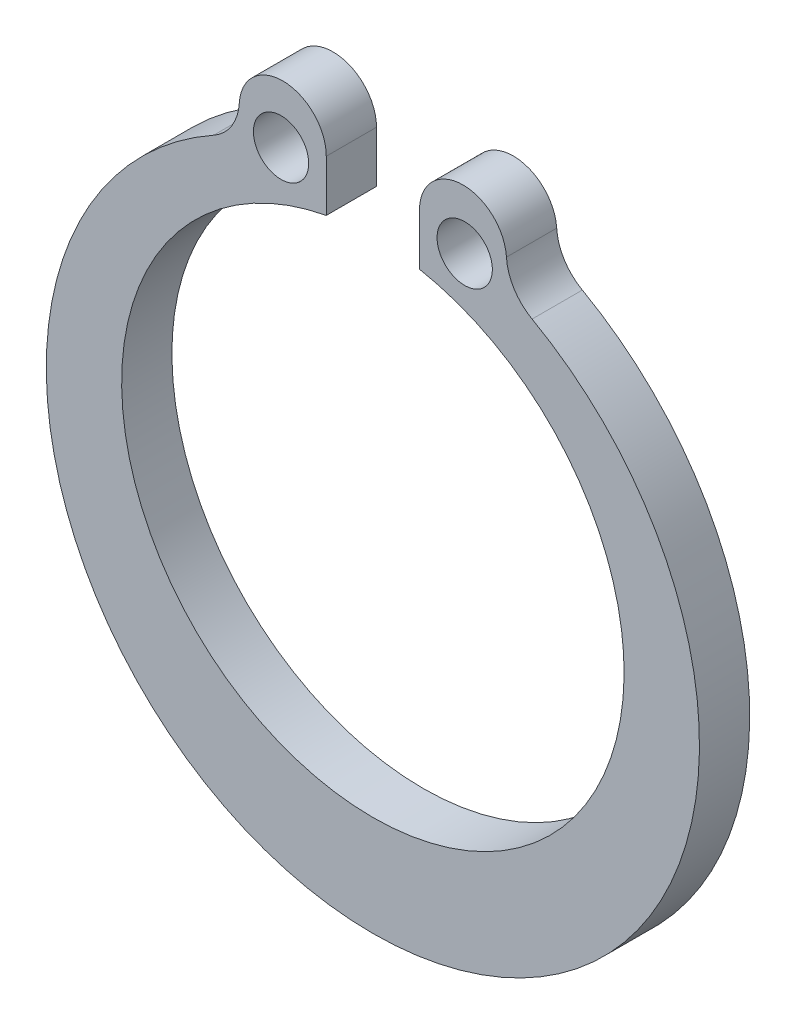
ISO-10303-21;
HEADER;
FILE_DESCRIPTION(('STEP AP214'),'2;1');
FILE_NAME('part.step','',(''),(''),'','','');
FILE_SCHEMA(('AUTOMOTIVE_DESIGN { 1 0 10303 214 1 1 1 1 }'));
ENDSEC;
DATA;
#1=APPLICATION_CONTEXT('core data for automotive mechanical design processes');
#2=APPLICATION_PROTOCOL_DEFINITION('international standard','automotive_design',2000,#1);
#3=PRODUCT_CONTEXT('',#1,'mechanical');
#4=PRODUCT('Part','Part','',(#3));
#5=PRODUCT_RELATED_PRODUCT_CATEGORY('part','',(#4));
#6=PRODUCT_DEFINITION_FORMATION('','',#4);
#7=PRODUCT_DEFINITION_CONTEXT('part definition',#1,'design');
#8=PRODUCT_DEFINITION('design','',#6,#7);
#9=PRODUCT_DEFINITION_SHAPE('','',#8);
#10=(LENGTH_UNIT() NAMED_UNIT(*) SI_UNIT(.MILLI.,.METRE.));
#11=(NAMED_UNIT(*) PLANE_ANGLE_UNIT() SI_UNIT($,.RADIAN.));
#12=(NAMED_UNIT(*) SI_UNIT($,.STERADIAN.) SOLID_ANGLE_UNIT());
#13=UNCERTAINTY_MEASURE_WITH_UNIT(LENGTH_MEASURE(1.E-05),#10,'distance_accuracy_value','');
#14=(GEOMETRIC_REPRESENTATION_CONTEXT(3) GLOBAL_UNCERTAINTY_ASSIGNED_CONTEXT((#13)) GLOBAL_UNIT_ASSIGNED_CONTEXT((#10,
#11,#12)) REPRESENTATION_CONTEXT('',''));
#15=CARTESIAN_POINT('',(0.,0.,0.));
#16=DIRECTION('',(0.,0.,1.));
#17=DIRECTION('',(1.,0.,0.));
#18=AXIS2_PLACEMENT_3D('',#15,#16,#17);
#19=CARTESIAN_POINT('',(-1.79373456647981,5.93348372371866,1.));
#20=DIRECTION('',(0.,0.,1.));
#21=DIRECTION('',(1.,0.,0.));
#22=AXIS2_PLACEMENT_3D('',#19,#20,#21);
#23=PLANE('',#22);
#24=CARTESIAN_POINT('',(-1.79373456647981,5.93348372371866,1.));
#25=DIRECTION('',(0.,0.,1.));
#26=DIRECTION('',(1.,0.,0.));
#27=AXIS2_PLACEMENT_3D('',#24,#25,#26);
#28=CIRCLE('',#27,0.866217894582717);
#29=CARTESIAN_POINT('',(-0.927516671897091,5.93348372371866,1.));
#30=VERTEX_POINT('',#29);
#31=CARTESIAN_POINT('',(-2.65831066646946,5.98679046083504,1.));
#32=VERTEX_POINT('',#31);
#33=EDGE_CURVE('E121',#30,#32,#28,.T.);
#34=ORIENTED_EDGE('',*,*,#33,.T.);
#35=CARTESIAN_POINT('',(-3.65641530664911,6.04833010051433,1.));
#36=DIRECTION('',(0.,0.,1.));
#37=DIRECTION('',(1.,0.,0.));
#38=AXIS2_PLACEMENT_3D('',#35,#36,#37);
#39=CIRCLE('',#38,1.);
#40=CARTESIAN_POINT('',(-3.16889326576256,5.17521942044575,1.));
#41=VERTEX_POINT('',#40);
#42=EDGE_CURVE('E149',#32,#41,#39,.F.);
#43=ORIENTED_EDGE('',*,*,#42,.T.);
#44=CARTESIAN_POINT('',(0.,-0.5,1.));
#45=DIRECTION('',(0.,0.,1.));
#46=DIRECTION('',(1.,0.,0.));
#47=AXIS2_PLACEMENT_3D('',#44,#45,#46);
#48=CIRCLE('',#47,6.5);
#49=CARTESIAN_POINT('',(3.16889326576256,5.17521942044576,1.));
#50=VERTEX_POINT('',#49);
#51=EDGE_CURVE('E124',#41,#50,#48,.T.);
#52=ORIENTED_EDGE('',*,*,#51,.T.);
#53=CARTESIAN_POINT('',(3.65641530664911,6.04833010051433,1.));
#54=DIRECTION('',(0.,0.,1.));
#55=DIRECTION('',(1.,0.,0.));
#56=AXIS2_PLACEMENT_3D('',#53,#54,#55);
#57=CIRCLE('',#56,1.);
#58=CARTESIAN_POINT('',(2.65831066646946,5.98679046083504,1.));
#59=VERTEX_POINT('',#58);
#60=EDGE_CURVE('E11',#50,#59,#57,.F.);
#61=ORIENTED_EDGE('',*,*,#60,.T.);
#62=CARTESIAN_POINT('',(1.79373456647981,5.93348372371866,1.));
#63=DIRECTION('',(0.,0.,1.));
#64=DIRECTION('',(-1.,0.,0.));
#65=AXIS2_PLACEMENT_3D('',#62,#63,#64);
#66=CIRCLE('',#65,0.866217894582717);
#67=CARTESIAN_POINT('',(0.927516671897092,5.93348372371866,1.));
#68=VERTEX_POINT('',#67);
#69=EDGE_CURVE('E126',#59,#68,#66,.T.);
#70=ORIENTED_EDGE('',*,*,#69,.T.);
#71=DIRECTION('',(0.,-1.,0.));
#72=VECTOR('',#71,1.);
#73=CARTESIAN_POINT('',(0.927516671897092,5.93348372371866,1.));
#74=LINE('',#73,#72);
#75=CARTESIAN_POINT('',(0.927516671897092,4.91321817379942,1.));
#76=VERTEX_POINT('',#75);
#77=EDGE_CURVE('E105',#68,#76,#74,.T.);
#78=ORIENTED_EDGE('',*,*,#77,.T.);
#79=CARTESIAN_POINT('',(0.,0.,1.));
#80=DIRECTION('',(0.,0.,-1.));
#81=DIRECTION('',(1.,0.,0.));
#82=AXIS2_PLACEMENT_3D('',#79,#80,#81);
#83=CIRCLE('',#82,5.);
#84=CARTESIAN_POINT('',(-0.927516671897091,4.91321817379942,1.));
#85=VERTEX_POINT('',#84);
#86=EDGE_CURVE('E129',#76,#85,#83,.T.);
#87=ORIENTED_EDGE('',*,*,#86,.T.);
#88=DIRECTION('',(0.,1.,0.));
#89=VECTOR('',#88,1.);
#90=CARTESIAN_POINT('',(-0.927516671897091,5.93348372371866,1.));
#91=LINE('',#90,#89);
#92=EDGE_CURVE('E131',#85,#30,#91,.T.);
#93=ORIENTED_EDGE('',*,*,#92,.T.);
#94=EDGE_LOOP('',(#34,#43,#52,#61,#70,#78,#87,#93));
#95=FACE_BOUND('',#94,.T.);
#96=CARTESIAN_POINT('',(-1.82751667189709,5.63323328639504,1.));
#97=DIRECTION('',(0.,0.,1.));
#98=DIRECTION('',(1.,0.,0.));
#99=AXIS2_PLACEMENT_3D('',#96,#97,#98);
#100=CIRCLE('',#99,0.55);
#101=CARTESIAN_POINT('',(-1.27751667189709,5.63323328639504,1.));
#102=VERTEX_POINT('',#101);
#103=EDGE_CURVE('E208',#102,#102,#100,.T.);
#104=ORIENTED_EDGE('',*,*,#103,.F.);
#105=EDGE_LOOP('',(#104));
#106=FACE_BOUND('',#105,.T.);
#107=CARTESIAN_POINT('',(1.82751667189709,5.63323328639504,1.));
#108=DIRECTION('',(0.,0.,-1.));
#109=DIRECTION('',(-1.,0.,0.));
#110=AXIS2_PLACEMENT_3D('',#107,#108,#109);
#111=CIRCLE('',#110,0.55);
#112=CARTESIAN_POINT('',(1.27751667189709,5.63323328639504,1.));
#113=VERTEX_POINT('',#112);
#114=EDGE_CURVE('E216',#113,#113,#111,.T.);
#115=ORIENTED_EDGE('',*,*,#114,.T.);
#116=EDGE_LOOP('',(#115));
#117=FACE_BOUND('',#116,.T.);
#118=ADVANCED_FACE('F26',(#95,#106,#117),#23,.T.);
#119=CARTESIAN_POINT('',(-1.79373456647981,5.93348372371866,0.));
#120=DIRECTION('',(0.,0.,1.));
#121=DIRECTION('',(1.,0.,0.));
#122=AXIS2_PLACEMENT_3D('',#119,#120,#121);
#123=PLANE('',#122);
#124=CARTESIAN_POINT('',(-1.79373456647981,5.93348372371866,0.));
#125=DIRECTION('',(0.,0.,1.));
#126=DIRECTION('',(1.,0.,0.));
#127=AXIS2_PLACEMENT_3D('',#124,#125,#126);
#128=CIRCLE('',#127,0.866217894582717);
#129=CARTESIAN_POINT('',(-0.927516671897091,5.93348372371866,0.));
#130=VERTEX_POINT('',#129);
#131=CARTESIAN_POINT('',(-2.65831066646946,5.98679046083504,0.));
#132=VERTEX_POINT('',#131);
#133=EDGE_CURVE('E156',#130,#132,#128,.T.);
#134=ORIENTED_EDGE('',*,*,#133,.F.);
#135=DIRECTION('',(0.,1.,0.));
#136=VECTOR('',#135,1.);
#137=CARTESIAN_POINT('',(-0.927516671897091,5.93348372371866,0.));
#138=LINE('',#137,#136);
#139=CARTESIAN_POINT('',(-0.927516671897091,4.91321817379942,0.));
#140=VERTEX_POINT('',#139);
#141=EDGE_CURVE('E116',#140,#130,#138,.T.);
#142=ORIENTED_EDGE('',*,*,#141,.F.);
#143=CARTESIAN_POINT('',(0.,0.,0.));
#144=DIRECTION('',(0.,0.,-1.));
#145=DIRECTION('',(1.,0.,0.));
#146=AXIS2_PLACEMENT_3D('',#143,#144,#145);
#147=CIRCLE('',#146,5.);
#148=CARTESIAN_POINT('',(0.927516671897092,4.91321817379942,0.));
#149=VERTEX_POINT('',#148);
#150=EDGE_CURVE('E114',#149,#140,#147,.T.);
#151=ORIENTED_EDGE('',*,*,#150,.F.);
#152=DIRECTION('',(0.,-1.,0.));
#153=VECTOR('',#152,1.);
#154=CARTESIAN_POINT('',(0.927516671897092,5.93348372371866,0.));
#155=LINE('',#154,#153);
#156=CARTESIAN_POINT('',(0.927516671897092,5.93348372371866,0.));
#157=VERTEX_POINT('',#156);
#158=EDGE_CURVE('E98',#157,#149,#155,.T.);
#159=ORIENTED_EDGE('',*,*,#158,.F.);
#160=CARTESIAN_POINT('',(1.79373456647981,5.93348372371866,0.));
#161=DIRECTION('',(0.,0.,1.));
#162=DIRECTION('',(-1.,0.,0.));
#163=AXIS2_PLACEMENT_3D('',#160,#161,#162);
#164=CIRCLE('',#163,0.866217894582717);
#165=CARTESIAN_POINT('',(2.65831066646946,5.98679046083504,0.));
#166=VERTEX_POINT('',#165);
#167=EDGE_CURVE('E90',#166,#157,#164,.T.);
#168=ORIENTED_EDGE('',*,*,#167,.F.);
#169=CARTESIAN_POINT('',(3.65641530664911,6.04833010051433,0.));
#170=DIRECTION('',(0.,0.,1.));
#171=DIRECTION('',(1.,0.,0.));
#172=AXIS2_PLACEMENT_3D('',#169,#170,#171);
#173=CIRCLE('',#172,1.);
#174=CARTESIAN_POINT('',(3.16889326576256,5.17521942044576,0.));
#175=VERTEX_POINT('',#174);
#176=EDGE_CURVE('E34',#166,#175,#173,.T.);
#177=ORIENTED_EDGE('',*,*,#176,.T.);
#178=CARTESIAN_POINT('',(0.,-0.5,0.));
#179=DIRECTION('',(0.,0.,1.));
#180=DIRECTION('',(1.,0.,0.));
#181=AXIS2_PLACEMENT_3D('',#178,#179,#180);
#182=CIRCLE('',#181,6.5);
#183=CARTESIAN_POINT('',(-3.16889326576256,5.17521942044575,0.));
#184=VERTEX_POINT('',#183);
#185=EDGE_CURVE('E99',#184,#175,#182,.T.);
#186=ORIENTED_EDGE('',*,*,#185,.F.);
#187=CARTESIAN_POINT('',(-3.65641530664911,6.04833010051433,0.));
#188=DIRECTION('',(0.,0.,1.));
#189=DIRECTION('',(1.,0.,0.));
#190=AXIS2_PLACEMENT_3D('',#187,#188,#189);
#191=CIRCLE('',#190,1.);
#192=EDGE_CURVE('E147',#184,#132,#191,.T.);
#193=ORIENTED_EDGE('',*,*,#192,.T.);
#194=EDGE_LOOP('',(#134,#142,#151,#159,#168,#177,#186,#193));
#195=FACE_BOUND('',#194,.T.);
#196=CARTESIAN_POINT('',(-1.82751667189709,5.63323328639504,0.));
#197=DIRECTION('',(0.,0.,1.));
#198=DIRECTION('',(1.,0.,0.));
#199=AXIS2_PLACEMENT_3D('',#196,#197,#198);
#200=CIRCLE('',#199,0.55);
#201=CARTESIAN_POINT('',(-1.27751667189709,5.63323328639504,0.));
#202=VERTEX_POINT('',#201);
#203=EDGE_CURVE('E201',#202,#202,#200,.T.);
#204=ORIENTED_EDGE('',*,*,#203,.T.);
#205=EDGE_LOOP('',(#204));
#206=FACE_BOUND('',#205,.T.);
#207=CARTESIAN_POINT('',(1.82751667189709,5.63323328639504,0.));
#208=DIRECTION('',(0.,0.,-1.));
#209=DIRECTION('',(-1.,0.,0.));
#210=AXIS2_PLACEMENT_3D('',#207,#208,#209);
#211=CIRCLE('',#210,0.55);
#212=CARTESIAN_POINT('',(1.27751667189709,5.63323328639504,0.));
#213=VERTEX_POINT('',#212);
#214=EDGE_CURVE('E213',#213,#213,#211,.T.);
#215=ORIENTED_EDGE('',*,*,#214,.F.);
#216=EDGE_LOOP('',(#215));
#217=FACE_BOUND('',#216,.T.);
#218=ADVANCED_FACE('F111',(#195,#206,#217),#123,.F.);
#219=CARTESIAN_POINT('',(-1.79373456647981,5.93348372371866,1.));
#220=DIRECTION('',(0.,0.,-1.));
#221=DIRECTION('',(-1.,0.,0.));
#222=AXIS2_PLACEMENT_3D('',#219,#220,#221);
#223=CYLINDRICAL_SURFACE('',#222,0.866217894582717);
#224=ORIENTED_EDGE('',*,*,#133,.T.);
#225=DIRECTION('',(0.,0.,-1.));
#226=VECTOR('',#225,1.);
#227=CARTESIAN_POINT('',(-2.65831066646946,5.98679046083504,1.));
#228=LINE('',#227,#226);
#229=EDGE_CURVE('E144',#132,#32,#228,.F.);
#230=ORIENTED_EDGE('',*,*,#229,.T.);
#231=ORIENTED_EDGE('',*,*,#33,.F.);
#232=DIRECTION('',(0.,0.,-1.));
#233=VECTOR('',#232,1.);
#234=CARTESIAN_POINT('',(-0.927516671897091,5.93348372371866,1.));
#235=LINE('',#234,#233);
#236=EDGE_CURVE('E133',#30,#130,#235,.T.);
#237=ORIENTED_EDGE('',*,*,#236,.T.);
#238=EDGE_LOOP('',(#224,#230,#231,#237));
#239=FACE_BOUND('',#238,.T.);
#240=ADVANCED_FACE('F28',(#239),#223,.T.);
#241=CARTESIAN_POINT('',(0.,-0.5,1.));
#242=DIRECTION('',(0.,0.,-1.));
#243=DIRECTION('',(-1.,0.,0.));
#244=AXIS2_PLACEMENT_3D('',#241,#242,#243);
#245=CYLINDRICAL_SURFACE('',#244,6.5);
#246=ORIENTED_EDGE('',*,*,#51,.F.);
#247=DIRECTION('',(0.,0.,-1.));
#248=VECTOR('',#247,1.);
#249=CARTESIAN_POINT('',(-3.16889326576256,5.17521942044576,1.));
#250=LINE('',#249,#248);
#251=EDGE_CURVE('E141',#41,#184,#250,.T.);
#252=ORIENTED_EDGE('',*,*,#251,.T.);
#253=ORIENTED_EDGE('',*,*,#185,.T.);
#254=DIRECTION('',(0.,0.,-1.));
#255=VECTOR('',#254,1.);
#256=CARTESIAN_POINT('',(3.16889326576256,5.17521942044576,1.));
#257=LINE('',#256,#255);
#258=EDGE_CURVE('E106',#175,#50,#257,.F.);
#259=ORIENTED_EDGE('',*,*,#258,.T.);
#260=EDGE_LOOP('',(#246,#252,#253,#259));
#261=FACE_BOUND('',#260,.T.);
#262=ADVANCED_FACE('F154',(#261),#245,.T.);
#263=CARTESIAN_POINT('',(1.79373456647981,5.93348372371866,1.));
#264=DIRECTION('',(0.,0.,-1.));
#265=DIRECTION('',(-1.,0.,0.));
#266=AXIS2_PLACEMENT_3D('',#263,#264,#265);
#267=CYLINDRICAL_SURFACE('',#266,0.866217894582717);
#268=ORIENTED_EDGE('',*,*,#69,.F.);
#269=DIRECTION('',(0.,0.,-1.));
#270=VECTOR('',#269,1.);
#271=CARTESIAN_POINT('',(2.65831066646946,5.98679046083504,1.));
#272=LINE('',#271,#270);
#273=EDGE_CURVE('E95',#59,#166,#272,.T.);
#274=ORIENTED_EDGE('',*,*,#273,.T.);
#275=ORIENTED_EDGE('',*,*,#167,.T.);
#276=DIRECTION('',(0.,0.,-1.));
#277=VECTOR('',#276,1.);
#278=CARTESIAN_POINT('',(0.927516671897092,5.93348372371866,1.));
#279=LINE('',#278,#277);
#280=EDGE_CURVE('E93',#68,#157,#279,.T.);
#281=ORIENTED_EDGE('',*,*,#280,.F.);
#282=EDGE_LOOP('',(#268,#274,#275,#281));
#283=FACE_BOUND('',#282,.T.);
#284=ADVANCED_FACE('F92',(#283),#267,.T.);
#285=CARTESIAN_POINT('',(0.927516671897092,5.93348372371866,1.));
#286=DIRECTION('',(1.,0.,0.));
#287=DIRECTION('',(0.,1.,0.));
#288=AXIS2_PLACEMENT_3D('',#285,#286,#287);
#289=PLANE('',#288);
#290=ORIENTED_EDGE('',*,*,#158,.T.);
#291=DIRECTION('',(0.,0.,-1.));
#292=VECTOR('',#291,1.);
#293=CARTESIAN_POINT('',(0.927516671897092,4.91321817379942,1.));
#294=LINE('',#293,#292);
#295=EDGE_CURVE('E107',#76,#149,#294,.T.);
#296=ORIENTED_EDGE('',*,*,#295,.F.);
#297=ORIENTED_EDGE('',*,*,#77,.F.);
#298=ORIENTED_EDGE('',*,*,#280,.T.);
#299=EDGE_LOOP('',(#290,#296,#297,#298));
#300=FACE_BOUND('',#299,.T.);
#301=ADVANCED_FACE('F102',(#300),#289,.F.);
#302=CARTESIAN_POINT('',(0.,0.,1.));
#303=DIRECTION('',(0.,0.,-1.));
#304=DIRECTION('',(-1.,0.,0.));
#305=AXIS2_PLACEMENT_3D('',#302,#303,#304);
#306=CYLINDRICAL_SURFACE('',#305,5.);
#307=ORIENTED_EDGE('',*,*,#150,.T.);
#308=DIRECTION('',(0.,0.,-1.));
#309=VECTOR('',#308,1.);
#310=CARTESIAN_POINT('',(-0.927516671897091,4.91321817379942,1.));
#311=LINE('',#310,#309);
#312=EDGE_CURVE('E136',#85,#140,#311,.T.);
#313=ORIENTED_EDGE('',*,*,#312,.F.);
#314=ORIENTED_EDGE('',*,*,#86,.F.);
#315=ORIENTED_EDGE('',*,*,#295,.T.);
#316=EDGE_LOOP('',(#307,#313,#314,#315));
#317=FACE_BOUND('',#316,.T.);
#318=ADVANCED_FACE('F182',(#317),#306,.F.);
#319=CARTESIAN_POINT('',(-0.927516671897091,5.93348372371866,1.));
#320=DIRECTION('',(-1.,0.,0.));
#321=DIRECTION('',(0.,0.,1.));
#322=AXIS2_PLACEMENT_3D('',#319,#320,#321);
#323=PLANE('',#322);
#324=ORIENTED_EDGE('',*,*,#141,.T.);
#325=ORIENTED_EDGE('',*,*,#236,.F.);
#326=ORIENTED_EDGE('',*,*,#92,.F.);
#327=ORIENTED_EDGE('',*,*,#312,.T.);
#328=EDGE_LOOP('',(#324,#325,#326,#327));
#329=FACE_BOUND('',#328,.T.);
#330=ADVANCED_FACE('F169',(#329),#323,.F.);
#331=CARTESIAN_POINT('',(-3.65641530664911,6.04833010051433,1.));
#332=DIRECTION('',(0.,0.,1.));
#333=DIRECTION('',(1.,0.,0.));
#334=AXIS2_PLACEMENT_3D('',#331,#332,#333);
#335=CYLINDRICAL_SURFACE('',#334,1.);
#336=ORIENTED_EDGE('',*,*,#42,.F.);
#337=ORIENTED_EDGE('',*,*,#229,.F.);
#338=ORIENTED_EDGE('',*,*,#192,.F.);
#339=ORIENTED_EDGE('',*,*,#251,.F.);
#340=EDGE_LOOP('',(#336,#337,#338,#339));
#341=FACE_BOUND('',#340,.T.);
#342=ADVANCED_FACE('F160',(#341),#335,.F.);
#343=CARTESIAN_POINT('',(3.65641530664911,6.04833010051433,1.));
#344=DIRECTION('',(0.,0.,1.));
#345=DIRECTION('',(1.,0.,0.));
#346=AXIS2_PLACEMENT_3D('',#343,#344,#345);
#347=CYLINDRICAL_SURFACE('',#346,1.);
#348=ORIENTED_EDGE('',*,*,#60,.F.);
#349=ORIENTED_EDGE('',*,*,#258,.F.);
#350=ORIENTED_EDGE('',*,*,#176,.F.);
#351=ORIENTED_EDGE('',*,*,#273,.F.);
#352=EDGE_LOOP('',(#348,#349,#350,#351));
#353=FACE_BOUND('',#352,.T.);
#354=ADVANCED_FACE('F157',(#353),#347,.F.);
#355=CARTESIAN_POINT('',(-1.82751667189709,5.63323328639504,0.));
#356=DIRECTION('',(0.,0.,1.));
#357=DIRECTION('',(1.,0.,0.));
#358=AXIS2_PLACEMENT_3D('',#355,#356,#357);
#359=CYLINDRICAL_SURFACE('',#358,0.55);
#360=ORIENTED_EDGE('',*,*,#203,.F.);
#361=EDGE_LOOP('',(#360));
#362=FACE_BOUND('',#361,.T.);
#363=ORIENTED_EDGE('',*,*,#103,.T.);
#364=EDGE_LOOP('',(#363));
#365=FACE_BOUND('',#364,.T.);
#366=ADVANCED_FACE('F159',(#362,#365),#359,.F.);
#367=CARTESIAN_POINT('',(1.82751667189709,5.63323328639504,0.));
#368=DIRECTION('',(0.,0.,1.));
#369=DIRECTION('',(1.,0.,0.));
#370=AXIS2_PLACEMENT_3D('',#367,#368,#369);
#371=CYLINDRICAL_SURFACE('',#370,0.55);
#372=ORIENTED_EDGE('',*,*,#214,.T.);
#373=EDGE_LOOP('',(#372));
#374=FACE_BOUND('',#373,.T.);
#375=ORIENTED_EDGE('',*,*,#114,.F.);
#376=EDGE_LOOP('',(#375));
#377=FACE_BOUND('',#376,.T.);
#378=ADVANCED_FACE('F166',(#374,#377),#371,.F.);
#379=CLOSED_SHELL('',(#118,#218,#240,#262,#284,#301,#318,#330,#342,#354,#366,#378));
#380=MANIFOLD_SOLID_BREP('B2',#379);
#381=ADVANCED_BREP_SHAPE_REPRESENTATION('',(#18,#380),#14);
#382=SHAPE_DEFINITION_REPRESENTATION(#9,#381);
ENDSEC;
END-ISO-10303-21;
